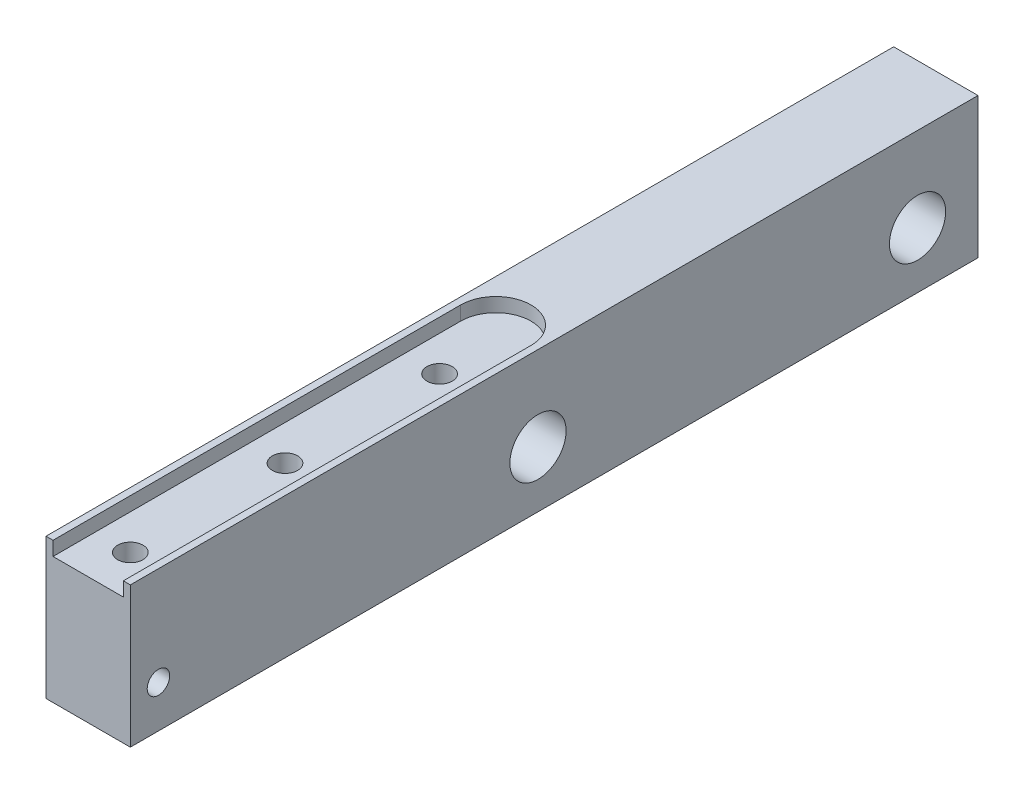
from build123d import *

# Parameters (mm, degrees)
ESQUISSE1_W                = 30
ESQUISSE1_H                = 50
EXTRUSION1_DEPTH           = 301.5
ENL_V_MAT_EXTRU_1_REACH    = 306.019
ESQUISSE2_R                = 10
ENL_V_MAT_EXTRU_2_DEPTH    = 5
ENL_V_MAT_EXTRU_3_REACH    = 306.019
ESQUISSE4_R                = 4
R_P_TITION_LIN_AIRE1_COUNT = 3
R_P_TITION_LIN_AIRE1_PITCH = 55
R_P_TITION_LIN_AIRE2_COUNT = 2
R_P_TITION_LIN_AIRE2_PITCH = 150


with BuildPart() as part:
    # Esquisse1 → Extrusion1 (new body)
    with BuildSketch(Plane.XY):
        Rectangle(ESQUISSE1_W, ESQUISSE1_H)
    extrude(amount=EXTRUSION1_DEPTH)

    # Esquisse2 → Enl_v. mat.-Extru.1 (cut, up to next)
    with BuildSketch(Plane(origin=(15, 0, 0), x_dir=(0, 0, -1), z_dir=(1, 0, 0)), mode=Mode.PRIVATE) as enl_v_mat_extru_1_sk1:
        with Locations(Location((-156.5, -5, 0), (0, 0, 90))):
            Circle(ESQUISSE2_R)
    enl_v_mat_extru_1_tool1 = extrude(enl_v_mat_extru_1_sk1.sketch, amount=-ENL_V_MAT_EXTRU_1_REACH, mode=Mode.PRIVATE) & part.part
    # Esquisse2 → Enl_v. mat.-Extru.1 (cut, up to next)
    with BuildSketch(Plane(origin=(15, 0, 0), x_dir=(0, 0, -1), z_dir=(1, 0, 0)), mode=Mode.PRIVATE) as enl_v_mat_extru_1_sk2:
        with Locations(Location((-21.5, -5, 0), (0, 0, 90))):
            Circle(ESQUISSE2_R)
    enl_v_mat_extru_1_tool2 = extrude(enl_v_mat_extru_1_sk2.sketch, amount=-ENL_V_MAT_EXTRU_1_REACH, mode=Mode.PRIVATE) & part.part
    add(enl_v_mat_extru_1_tool1.solids().sort_by_distance((15, -5, 156.5))[0], mode=Mode.SUBTRACT)
    add(enl_v_mat_extru_1_tool2.solids().sort_by_distance((15, -5, 21.5))[0], mode=Mode.SUBTRACT)

    # Esquisse3 → Enl_v. mat.-Extru.2 (cut)
    with BuildSketch(Plane(origin=(0, 25, 0), x_dir=(-1, 0, 0), z_dir=(0, 1, 0))):
        with BuildLine():
            Line((12.5, 301.5), (-12.5, 301.5))
            Line((-12.5, 301.5), (-12.5, 156.5))
            ThreePointArc((-12.5, 156.5), (0, 144), (12.5, 156.5))
            Line((12.5, 156.5), (12.5, 301.5))
        make_face()
    extrude(amount=-ENL_V_MAT_EXTRU_2_DEPTH, mode=Mode.SUBTRACT)

    # Esquisse4 → Enl_v. mat.-Extru.3 (cut, up to next)
    with BuildSketch(Plane(origin=(15, 0, 0), x_dir=(0, 0, -1), z_dir=(1, 0, 0)), mode=Mode.PRIVATE) as enl_v_mat_extru_3_sk1:
        with Locations(Location((-291.5, -10, 0), (0, 0, 90))):
            Circle(ESQUISSE4_R)
    enl_v_mat_extru_3_tool1 = extrude(enl_v_mat_extru_3_sk1.sketch, amount=-ENL_V_MAT_EXTRU_3_REACH, mode=Mode.PRIVATE) & part.part
    add(enl_v_mat_extru_3_tool1.solids().sort_by_distance((15, -10, 291.5))[0], mode=Mode.SUBTRACT)

    # Esquisse5 → Enl_vement de mati_re-R_volution1 (revolve, cut)
    with BuildSketch(Plane(origin=(0, 0, 0), x_dir=(0, 0, -1), z_dir=(1, 0, 0)), mode=Mode.PRIVATE) as enl_vement_de_mati_re_r_volution1_sk:
        Polygon((-172, -5), (-176.5, -7.598076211), (-176.5, 23.03125), (-172, 23.03125), align=None)
    enl_vement_de_mati_re_r_volution1 = revolve(enl_vement_de_mati_re_r_volution1_sk.sketch.rotate(Axis((0, 36.524305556, 176.5), (0, -1, 0)), 180), axis=Axis((0, 36.524305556, 176.5), (0, -1, 0)), mode=Mode.SUBTRACT)

    # R_p_tition lin_aire1: Enl_vement de mati_re-R_volution1 ×3
    with Locations(*[(0, 0, i * R_P_TITION_LIN_AIRE1_PITCH) for i in range(1, R_P_TITION_LIN_AIRE1_COUNT)]):
        add(enl_vement_de_mati_re_r_volution1, mode=Mode.SUBTRACT)

    # Esquisse8 → Enl_vement de mati_re-R_volution3 (revolve, cut)
    with BuildSketch(Plane(origin=(0, 0, 0), x_dir=(0, 0, -1), z_dir=(1, 0, 0))):
        Polygon((-51.5, -26.981810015), (-49, -26.981810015), (-49, -10), (-51.5, -8.556624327), align=None)
    enl_vement_de_mati_re_r_volution3 = revolve(axis=Axis((0, -41.955523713, 51.5), (0, 1, 0)), mode=Mode.SUBTRACT)

    # R_p_tition lin_aire2: Enl_vement de mati_re-R_volution3 ×2
    with Locations(*[(0, 0, i * R_P_TITION_LIN_AIRE2_PITCH) for i in range(1, R_P_TITION_LIN_AIRE2_COUNT)]):
        add(enl_vement_de_mati_re_r_volution3, mode=Mode.SUBTRACT)


solid = part.part
